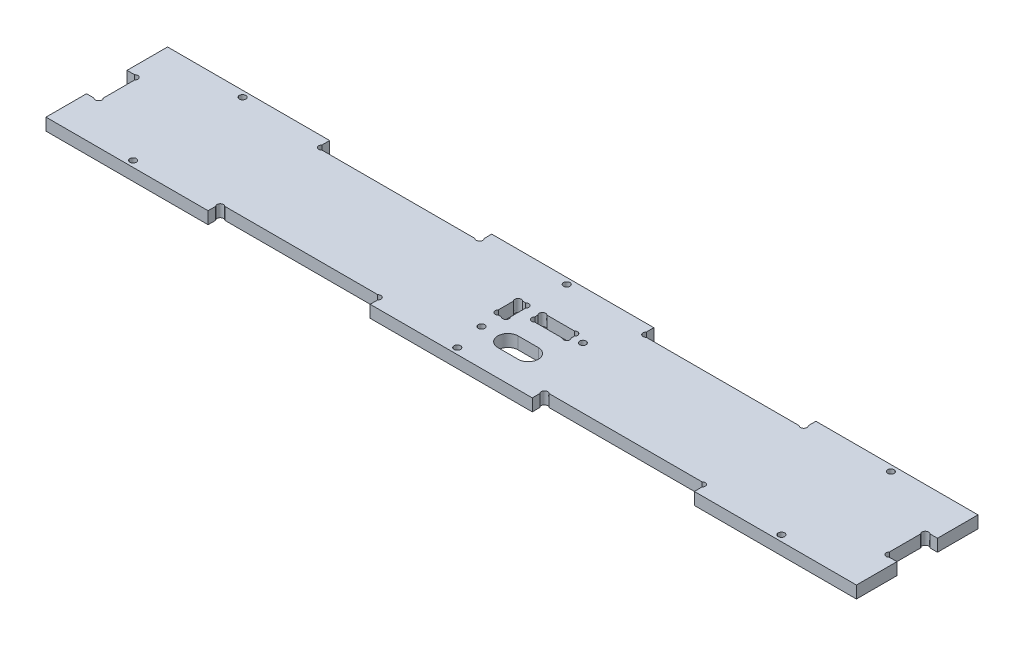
from build123d import *

# Parameters (mm, degrees)
ESQUISSE1_R        = 1.6
BOSS_EXTRU_1_DEPTH = 6


with BuildPart() as part:
    # Esquisse1 → Boss.-Extru.1 (new body)
    with BuildSketch(Plane(origin=(0, 0, 0), x_dir=(1, 0, 0), z_dir=(0, 1, 0))):
        with BuildLine():
            Line((-200, 30), (-120, 30))
            Line((-120, 30), (-120, 26.2627417))
            ThreePointArc((-120, 26.2627417), (-120, 24), (-117.7372583, 24))
            Line((-117.7372583, 24), (-42.2627417, 24))
            ThreePointArc((-42.2627417, 24), (-40, 24), (-40, 26.2627417))
            Line((-40, 26.2627417), (-40, 30))
            Line((-40, 30), (40, 30))
            Line((40, 30), (40, 26.2627417))
            ThreePointArc((40, 26.2627417), (40, 24), (42.2627417, 24))
            Line((42.2627417, 24), (117.7372583, 24))
            ThreePointArc((117.7372583, 24), (120, 24), (120, 26.2627417))
            Line((120, 26.2627417), (120, 30))
            Line((120, 30), (200, 30))
            Line((200, 30), (200, 10))
            Line((200, 10), (196.2627417, 10))
            ThreePointArc((196.2627417, 10), (194, 10), (194, 7.7372583))
            Line((194, 7.7372583), (194, -7.7372583))
            ThreePointArc((194, -7.7372583), (194, -10), (196.2627417, -10))
            Line((196.2627417, -10), (200, -10))
            Line((200, -10), (200, -30))
            Line((200, -30), (120, -30))
            Line((120, -30), (120, -26.2627417))
            ThreePointArc((120, -26.2627417), (120, -24), (117.7372583, -24))
            Line((117.7372583, -24), (42.2627417, -24))
            ThreePointArc((42.2627417, -24), (40, -24), (40, -26.2627417))
            Line((40, -26.2627417), (40, -30))
            Line((40, -30), (-40, -30))
            Line((-40, -30), (-40, -26.2627417))
            ThreePointArc((-40, -26.2627417), (-40, -24), (-42.2627417, -24))
            Line((-42.2627417, -24), (-117.7372583, -24))
            ThreePointArc((-117.7372583, -24), (-120, -24), (-120, -26.2627417))
            Line((-120, -26.2627417), (-120, -30))
            Line((-120, -30), (-200, -30))
            Line((-200, -30), (-200, -10))
            Line((-200, -10), (-196.2627417, -10))
            ThreePointArc((-196.2627417, -10), (-194, -10), (-194, -7.7372583))
            Line((-194, -7.7372583), (-194, 7.7372583))
            ThreePointArc((-194, 7.7372583), (-194, 10), (-196.2627417, 10))
            Line((-196.2627417, 10), (-200, 10))
            Line((-200, 10), (-200, 30))
        make_face()
        with Locations(Location((0, 27, 0), (0, 0, 270))):
            Circle(ESQUISSE1_R, mode=Mode.SUBTRACT)
        with Locations(Location((160, 27, 0), (0, 0, 90))):
            Circle(ESQUISSE1_R, mode=Mode.SUBTRACT)
        with Locations(Location((-160, 27, 0), (0, 0, 270))):
            Circle(ESQUISSE1_R, mode=Mode.SUBTRACT)
        with Locations(Location((0, -27, 0), (0, 0, 90))):
            Circle(ESQUISSE1_R, mode=Mode.SUBTRACT)
        with Locations(Location((160, -27, 0), (0, 0, 270))):
            Circle(ESQUISSE1_R, mode=Mode.SUBTRACT)
        with Locations(Location((-160, -27, 0), (0, 0, 90))):
            Circle(ESQUISSE1_R, mode=Mode.SUBTRACT)
        with Locations(Location((29, 6, 0), (0, 0, 90))):
            Circle(ESQUISSE1_R, mode=Mode.SUBTRACT)
        with Locations(Location((-3, -12, 0), (0, 0, 270))):
            Circle(ESQUISSE1_R, mode=Mode.SUBTRACT)
        with BuildLine():
            Line((8.2627417, 9), (21.7372583, 9))
            ThreePointArc((21.7372583, 9), (24, 9), (24, 6.7372583))
            Line((24, 6.7372583), (24, 5.2627417))
            ThreePointArc((24, 5.2627417), (24, 3), (21.7372583, 3))
            Line((21.7372583, 3), (8.2627417, 3))
            ThreePointArc((8.2627417, 3), (6, 3), (6, 5.2627417))
            Line((6, 5.2627417), (6, 6.7372583))
            ThreePointArc((6, 6.7372583), (6, 9), (8.2627417, 9))
        make_face(mode=Mode.SUBTRACT)
        with BuildLine():
            Line((10, -7), (20, -7))
            ThreePointArc((20, -7), (25, -12), (20, -17))
            Line((20, -17), (10, -17))
            ThreePointArc((10, -17), (5, -12), (10, -7))
        make_face(mode=Mode.SUBTRACT)
        with BuildLine():
            Line((-3.7372583, 9), (-2.2627417, 9))
            ThreePointArc((-2.2627417, 9), (0, 9), (0, 6.7372583))
            Line((0, 6.7372583), (0, -0.7372583))
            ThreePointArc((0, -0.7372583), (0, -3), (-2.2627417, -3))
            Line((-2.2627417, -3), (-3.7372583, -3))
            ThreePointArc((-3.7372583, -3), (-6, -3), (-6, -0.7372583))
            Line((-6, -0.7372583), (-6, 6.7372583))
            ThreePointArc((-6, 6.7372583), (-6, 9), (-3.7372583, 9))
        make_face(mode=Mode.SUBTRACT)
    extrude(amount=BOSS_EXTRU_1_DEPTH)


solid = part.part
